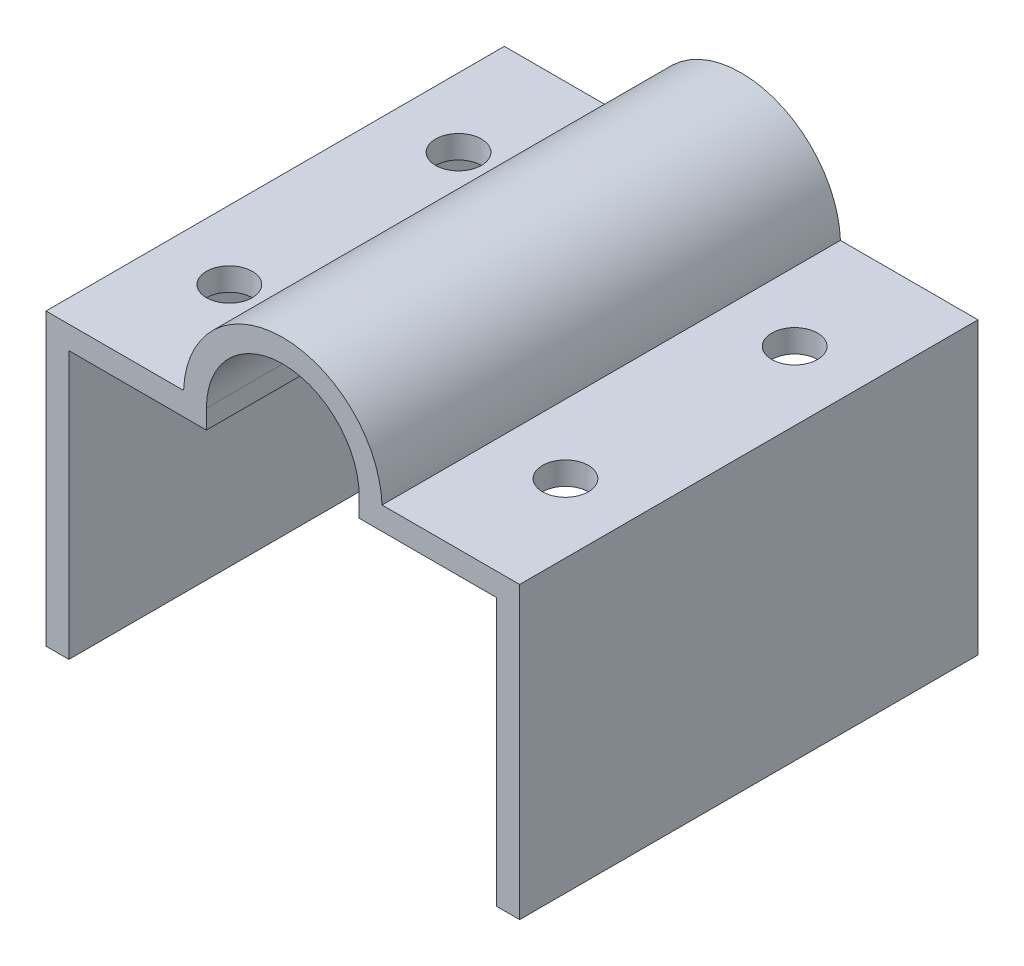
ISO-10303-21;
HEADER;
FILE_DESCRIPTION(('STEP AP214'),'2;1');
FILE_NAME('part.step','',(''),(''),'','','');
FILE_SCHEMA(('AUTOMOTIVE_DESIGN { 1 0 10303 214 1 1 1 1 }'));
ENDSEC;
DATA;
#1=APPLICATION_CONTEXT('core data for automotive mechanical design processes');
#2=APPLICATION_PROTOCOL_DEFINITION('international standard','automotive_design',2000,#1);
#3=PRODUCT_CONTEXT('',#1,'mechanical');
#4=PRODUCT('Part','Part','',(#3));
#5=PRODUCT_RELATED_PRODUCT_CATEGORY('part','',(#4));
#6=PRODUCT_DEFINITION_FORMATION('','',#4);
#7=PRODUCT_DEFINITION_CONTEXT('part definition',#1,'design');
#8=PRODUCT_DEFINITION('design','',#6,#7);
#9=PRODUCT_DEFINITION_SHAPE('','',#8);
#10=(LENGTH_UNIT() NAMED_UNIT(*) SI_UNIT(.MILLI.,.METRE.));
#11=(NAMED_UNIT(*) PLANE_ANGLE_UNIT() SI_UNIT($,.RADIAN.));
#12=(NAMED_UNIT(*) SI_UNIT($,.STERADIAN.) SOLID_ANGLE_UNIT());
#13=UNCERTAINTY_MEASURE_WITH_UNIT(LENGTH_MEASURE(1.E-05),#10,'distance_accuracy_value','');
#14=(GEOMETRIC_REPRESENTATION_CONTEXT(3) GLOBAL_UNCERTAINTY_ASSIGNED_CONTEXT((#13)) GLOBAL_UNIT_ASSIGNED_CONTEXT((#10,
#11,#12)) REPRESENTATION_CONTEXT('',''));
#15=CARTESIAN_POINT('',(0.,0.,0.));
#16=DIRECTION('',(0.,0.,1.));
#17=DIRECTION('',(1.,0.,0.));
#18=AXIS2_PLACEMENT_3D('',#15,#16,#17);
#19=CARTESIAN_POINT('',(-12.9903810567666,38.,30.));
#20=DIRECTION('',(0.,-1.,0.));
#21=DIRECTION('',(1.,0.,0.));
#22=AXIS2_PLACEMENT_3D('',#19,#20,#21);
#23=PLANE('',#22);
#24=CARTESIAN_POINT('',(-22.0000000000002,38.,15.));
#25=DIRECTION('',(0.,1.,0.));
#26=DIRECTION('',(0.,0.,1.));
#27=AXIS2_PLACEMENT_3D('',#24,#25,#26);
#28=CIRCLE('',#27,3.);
#29=CARTESIAN_POINT('',(-22.0000000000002,38.,18.));
#30=VERTEX_POINT('',#29);
#31=EDGE_CURVE('E456',#30,#30,#28,.T.);
#32=ORIENTED_EDGE('',*,*,#31,.F.);
#33=EDGE_LOOP('',(#32));
#34=FACE_BOUND('',#33,.T.);
#35=DIRECTION('',(-1.,0.,0.));
#36=VECTOR('',#35,1.);
#37=CARTESIAN_POINT('',(-12.9903810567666,38.,-30.));
#38=LINE('',#37,#36);
#39=CARTESIAN_POINT('',(-12.9903810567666,38.,-30.));
#40=VERTEX_POINT('',#39);
#41=CARTESIAN_POINT('',(-31.,38.,-30.));
#42=VERTEX_POINT('',#41);
#43=EDGE_CURVE('E99',#40,#42,#38,.T.);
#44=ORIENTED_EDGE('',*,*,#43,.T.);
#45=DIRECTION('',(0.,0.,-1.));
#46=VECTOR('',#45,1.);
#47=CARTESIAN_POINT('',(-31.,38.,30.));
#48=LINE('',#47,#46);
#49=CARTESIAN_POINT('',(-31.,38.,30.));
#50=VERTEX_POINT('',#49);
#51=EDGE_CURVE('E160',#50,#42,#48,.T.);
#52=ORIENTED_EDGE('',*,*,#51,.F.);
#53=DIRECTION('',(-1.,0.,0.));
#54=VECTOR('',#53,1.);
#55=CARTESIAN_POINT('',(-12.9903810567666,38.,30.));
#56=LINE('',#55,#54);
#57=CARTESIAN_POINT('',(-12.9903810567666,38.,30.));
#58=VERTEX_POINT('',#57);
#59=EDGE_CURVE('E148',#58,#50,#56,.T.);
#60=ORIENTED_EDGE('',*,*,#59,.F.);
#61=DIRECTION('',(0.,0.,-1.));
#62=VECTOR('',#61,1.);
#63=CARTESIAN_POINT('',(-12.9903810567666,38.,30.));
#64=LINE('',#63,#62);
#65=EDGE_CURVE('E155',#58,#40,#64,.T.);
#66=ORIENTED_EDGE('',*,*,#65,.T.);
#67=EDGE_LOOP('',(#44,#52,#60,#66));
#68=FACE_BOUND('',#67,.T.);
#69=CARTESIAN_POINT('',(-22.0000000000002,38.,-15.));
#70=DIRECTION('',(0.,1.,0.));
#71=DIRECTION('',(0.,0.,1.));
#72=AXIS2_PLACEMENT_3D('',#69,#70,#71);
#73=CIRCLE('',#72,3.);
#74=CARTESIAN_POINT('',(-22.0000000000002,38.,-12.));
#75=VERTEX_POINT('',#74);
#76=EDGE_CURVE('E458',#75,#75,#73,.T.);
#77=ORIENTED_EDGE('',*,*,#76,.F.);
#78=EDGE_LOOP('',(#77));
#79=FACE_BOUND('',#78,.T.);
#80=ADVANCED_FACE('F35',(#34,#68,#79),#23,.F.);
#81=CARTESIAN_POINT('',(31.,38.,30.));
#82=DIRECTION('',(0.,-1.,0.));
#83=DIRECTION('',(1.,0.,0.));
#84=AXIS2_PLACEMENT_3D('',#81,#82,#83);
#85=PLANE('',#84);
#86=CARTESIAN_POINT('',(21.9999999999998,38.,-15.));
#87=DIRECTION('',(0.,1.,0.));
#88=DIRECTION('',(0.,0.,1.));
#89=AXIS2_PLACEMENT_3D('',#86,#87,#88);
#90=CIRCLE('',#89,3.);
#91=CARTESIAN_POINT('',(21.9999999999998,38.,-12.));
#92=VERTEX_POINT('',#91);
#93=EDGE_CURVE('E466',#92,#92,#90,.T.);
#94=ORIENTED_EDGE('',*,*,#93,.F.);
#95=EDGE_LOOP('',(#94));
#96=FACE_BOUND('',#95,.T.);
#97=DIRECTION('',(-1.,0.,0.));
#98=VECTOR('',#97,1.);
#99=CARTESIAN_POINT('',(31.,38.,-30.));
#100=LINE('',#99,#98);
#101=CARTESIAN_POINT('',(31.,38.,-30.));
#102=VERTEX_POINT('',#101);
#103=CARTESIAN_POINT('',(12.9903810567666,38.,-30.));
#104=VERTEX_POINT('',#103);
#105=EDGE_CURVE('E190',#102,#104,#100,.T.);
#106=ORIENTED_EDGE('',*,*,#105,.T.);
#107=DIRECTION('',(0.,0.,-1.));
#108=VECTOR('',#107,1.);
#109=CARTESIAN_POINT('',(12.9903810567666,38.,30.));
#110=LINE('',#109,#108);
#111=CARTESIAN_POINT('',(12.9903810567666,38.,30.));
#112=VERTEX_POINT('',#111);
#113=EDGE_CURVE('E159',#112,#104,#110,.T.);
#114=ORIENTED_EDGE('',*,*,#113,.F.);
#115=DIRECTION('',(-1.,0.,0.));
#116=VECTOR('',#115,1.);
#117=CARTESIAN_POINT('',(31.,38.,30.));
#118=LINE('',#117,#116);
#119=CARTESIAN_POINT('',(31.,38.,30.));
#120=VERTEX_POINT('',#119);
#121=EDGE_CURVE('E150',#120,#112,#118,.T.);
#122=ORIENTED_EDGE('',*,*,#121,.F.);
#123=DIRECTION('',(0.,0.,-1.));
#124=VECTOR('',#123,1.);
#125=CARTESIAN_POINT('',(31.,38.,30.));
#126=LINE('',#125,#124);
#127=EDGE_CURVE('E199',#120,#102,#126,.T.);
#128=ORIENTED_EDGE('',*,*,#127,.T.);
#129=EDGE_LOOP('',(#106,#114,#122,#128));
#130=FACE_BOUND('',#129,.T.);
#131=CARTESIAN_POINT('',(21.9999999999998,38.,15.));
#132=DIRECTION('',(0.,1.,0.));
#133=DIRECTION('',(0.,0.,1.));
#134=AXIS2_PLACEMENT_3D('',#131,#132,#133);
#135=CIRCLE('',#134,3.);
#136=CARTESIAN_POINT('',(21.9999999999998,38.,18.));
#137=VERTEX_POINT('',#136);
#138=EDGE_CURVE('E472',#137,#137,#135,.T.);
#139=ORIENTED_EDGE('',*,*,#138,.F.);
#140=EDGE_LOOP('',(#139));
#141=FACE_BOUND('',#140,.T.);
#142=ADVANCED_FACE('F268',(#96,#130,#141),#85,.F.);
#143=CARTESIAN_POINT('',(-28.,0.,30.));
#144=DIRECTION('',(0.,1.,0.));
#145=DIRECTION('',(0.,0.,1.));
#146=AXIS2_PLACEMENT_3D('',#143,#144,#145);
#147=PLANE('',#146);
#148=DIRECTION('',(1.,0.,0.));
#149=VECTOR('',#148,1.);
#150=CARTESIAN_POINT('',(-28.,0.,-30.));
#151=LINE('',#150,#149);
#152=CARTESIAN_POINT('',(-31.,0.,-30.));
#153=VERTEX_POINT('',#152);
#154=CARTESIAN_POINT('',(-28.,0.,-30.));
#155=VERTEX_POINT('',#154);
#156=EDGE_CURVE('E168',#153,#155,#151,.T.);
#157=ORIENTED_EDGE('',*,*,#156,.T.);
#158=DIRECTION('',(0.,0.,-1.));
#159=VECTOR('',#158,1.);
#160=CARTESIAN_POINT('',(-28.,0.,30.));
#161=LINE('',#160,#159);
#162=CARTESIAN_POINT('',(-28.,0.,30.));
#163=VERTEX_POINT('',#162);
#164=EDGE_CURVE('E11',#163,#155,#161,.T.);
#165=ORIENTED_EDGE('',*,*,#164,.F.);
#166=DIRECTION('',(1.,0.,0.));
#167=VECTOR('',#166,1.);
#168=CARTESIAN_POINT('',(-28.,0.,30.));
#169=LINE('',#168,#167);
#170=CARTESIAN_POINT('',(-31.,0.,30.));
#171=VERTEX_POINT('',#170);
#172=EDGE_CURVE('E195',#171,#163,#169,.T.);
#173=ORIENTED_EDGE('',*,*,#172,.F.);
#174=DIRECTION('',(0.,0.,-1.));
#175=VECTOR('',#174,1.);
#176=CARTESIAN_POINT('',(-31.,0.,30.));
#177=LINE('',#176,#175);
#178=EDGE_CURVE('E164',#171,#153,#177,.T.);
#179=ORIENTED_EDGE('',*,*,#178,.T.);
#180=EDGE_LOOP('',(#157,#165,#173,#179));
#181=FACE_BOUND('',#180,.T.);
#182=ADVANCED_FACE('F37',(#181),#147,.F.);
#183=CARTESIAN_POINT('',(-28.,0.,30.));
#184=DIRECTION('',(-1.,0.,0.));
#185=DIRECTION('',(0.,-1.,0.));
#186=AXIS2_PLACEMENT_3D('',#183,#184,#185);
#187=PLANE('',#186);
#188=DIRECTION('',(0.,1.,0.));
#189=VECTOR('',#188,1.);
#190=CARTESIAN_POINT('',(-28.,0.,-30.));
#191=LINE('',#190,#189);
#192=CARTESIAN_POINT('',(-28.,35.,-30.));
#193=VERTEX_POINT('',#192);
#194=EDGE_CURVE('E171',#155,#193,#191,.T.);
#195=ORIENTED_EDGE('',*,*,#194,.T.);
#196=DIRECTION('',(0.,0.,-1.));
#197=VECTOR('',#196,1.);
#198=CARTESIAN_POINT('',(-28.,35.,30.));
#199=LINE('',#198,#197);
#200=CARTESIAN_POINT('',(-28.,35.,30.));
#201=VERTEX_POINT('',#200);
#202=EDGE_CURVE('E44',#201,#193,#199,.T.);
#203=ORIENTED_EDGE('',*,*,#202,.F.);
#204=DIRECTION('',(0.,1.,0.));
#205=VECTOR('',#204,1.);
#206=CARTESIAN_POINT('',(-28.,0.,30.));
#207=LINE('',#206,#205);
#208=EDGE_CURVE('E113',#163,#201,#207,.T.);
#209=ORIENTED_EDGE('',*,*,#208,.F.);
#210=ORIENTED_EDGE('',*,*,#164,.T.);
#211=EDGE_LOOP('',(#195,#203,#209,#210));
#212=FACE_BOUND('',#211,.T.);
#213=ADVANCED_FACE('F316',(#212),#187,.F.);
#214=CARTESIAN_POINT('',(-28.,35.,30.));
#215=DIRECTION('',(0.,1.,0.));
#216=DIRECTION('',(-1.,0.,0.));
#217=AXIS2_PLACEMENT_3D('',#214,#215,#216);
#218=PLANE('',#217);
#219=CARTESIAN_POINT('',(-22.0000000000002,35.,15.));
#220=DIRECTION('',(0.,1.,0.));
#221=DIRECTION('',(-1.,0.,0.));
#222=AXIS2_PLACEMENT_3D('',#219,#220,#221);
#223=CIRCLE('',#222,3.);
#224=CARTESIAN_POINT('',(-25.0000000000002,35.,15.));
#225=VERTEX_POINT('',#224);
#226=EDGE_CURVE('E454',#225,#225,#223,.T.);
#227=ORIENTED_EDGE('',*,*,#226,.T.);
#228=EDGE_LOOP('',(#227));
#229=FACE_BOUND('',#228,.T.);
#230=CARTESIAN_POINT('',(-22.0000000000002,35.,-15.));
#231=DIRECTION('',(0.,1.,0.));
#232=DIRECTION('',(-1.,0.,0.));
#233=AXIS2_PLACEMENT_3D('',#230,#231,#232);
#234=CIRCLE('',#233,3.);
#235=CARTESIAN_POINT('',(-25.0000000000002,35.,-15.));
#236=VERTEX_POINT('',#235);
#237=EDGE_CURVE('E463',#236,#236,#234,.T.);
#238=ORIENTED_EDGE('',*,*,#237,.T.);
#239=EDGE_LOOP('',(#238));
#240=FACE_BOUND('',#239,.T.);
#241=DIRECTION('',(1.,0.,0.));
#242=VECTOR('',#241,1.);
#243=CARTESIAN_POINT('',(-28.,35.,-30.));
#244=LINE('',#243,#242);
#245=CARTESIAN_POINT('',(-10.,35.,-30.));
#246=VERTEX_POINT('',#245);
#247=EDGE_CURVE('E174',#193,#246,#244,.T.);
#248=ORIENTED_EDGE('',*,*,#247,.T.);
#249=DIRECTION('',(0.,0.,-1.));
#250=VECTOR('',#249,1.);
#251=CARTESIAN_POINT('',(-10.,35.,30.));
#252=LINE('',#251,#250);
#253=CARTESIAN_POINT('',(-10.,35.,30.));
#254=VERTEX_POINT('',#253);
#255=EDGE_CURVE('E220',#254,#246,#252,.T.);
#256=ORIENTED_EDGE('',*,*,#255,.F.);
#257=DIRECTION('',(1.,0.,0.));
#258=VECTOR('',#257,1.);
#259=CARTESIAN_POINT('',(-28.,35.,30.));
#260=LINE('',#259,#258);
#261=EDGE_CURVE('E228',#201,#254,#260,.T.);
#262=ORIENTED_EDGE('',*,*,#261,.F.);
#263=ORIENTED_EDGE('',*,*,#202,.T.);
#264=EDGE_LOOP('',(#248,#256,#262,#263));
#265=FACE_BOUND('',#264,.T.);
#266=ADVANCED_FACE('F226',(#229,#240,#265),#218,.F.);
#267=CARTESIAN_POINT('',(-10.,35.,30.));
#268=DIRECTION('',(-1.,0.,0.));
#269=DIRECTION('',(0.,-1.,0.));
#270=AXIS2_PLACEMENT_3D('',#267,#268,#269);
#271=PLANE('',#270);
#272=DIRECTION('',(0.,1.,0.));
#273=VECTOR('',#272,1.);
#274=CARTESIAN_POINT('',(-10.,35.,-30.));
#275=LINE('',#274,#273);
#276=CARTESIAN_POINT('',(-10.,37.5,-30.));
#277=VERTEX_POINT('',#276);
#278=EDGE_CURVE('E176',#246,#277,#275,.T.);
#279=ORIENTED_EDGE('',*,*,#278,.T.);
#280=DIRECTION('',(0.,0.,-1.));
#281=VECTOR('',#280,1.);
#282=CARTESIAN_POINT('',(-10.,37.5,30.));
#283=LINE('',#282,#281);
#284=CARTESIAN_POINT('',(-10.,37.5,30.));
#285=VERTEX_POINT('',#284);
#286=EDGE_CURVE('E217',#285,#277,#283,.T.);
#287=ORIENTED_EDGE('',*,*,#286,.F.);
#288=DIRECTION('',(0.,1.,0.));
#289=VECTOR('',#288,1.);
#290=CARTESIAN_POINT('',(-10.,35.,30.));
#291=LINE('',#290,#289);
#292=EDGE_CURVE('E246',#254,#285,#291,.T.);
#293=ORIENTED_EDGE('',*,*,#292,.F.);
#294=ORIENTED_EDGE('',*,*,#255,.T.);
#295=EDGE_LOOP('',(#279,#287,#293,#294));
#296=FACE_BOUND('',#295,.T.);
#297=ADVANCED_FACE('F237',(#296),#271,.F.);
#298=CARTESIAN_POINT('',(0.,37.5,30.));
#299=DIRECTION('',(0.,0.,-1.));
#300=DIRECTION('',(-1.,0.,0.));
#301=AXIS2_PLACEMENT_3D('',#298,#299,#300);
#302=CYLINDRICAL_SURFACE('',#301,10.);
#303=CARTESIAN_POINT('',(0.,37.5,-30.));
#304=DIRECTION('',(0.,0.,-1.));
#305=DIRECTION('',(1.,0.,0.));
#306=AXIS2_PLACEMENT_3D('',#303,#304,#305);
#307=CIRCLE('',#306,10.);
#308=CARTESIAN_POINT('',(10.,37.5,-30.));
#309=VERTEX_POINT('',#308);
#310=EDGE_CURVE('E178',#277,#309,#307,.T.);
#311=ORIENTED_EDGE('',*,*,#310,.T.);
#312=DIRECTION('',(0.,0.,-1.));
#313=VECTOR('',#312,1.);
#314=CARTESIAN_POINT('',(10.,37.5,30.));
#315=LINE('',#314,#313);
#316=CARTESIAN_POINT('',(10.,37.5,30.));
#317=VERTEX_POINT('',#316);
#318=EDGE_CURVE('E214',#317,#309,#315,.T.);
#319=ORIENTED_EDGE('',*,*,#318,.F.);
#320=CARTESIAN_POINT('',(0.,37.5,30.));
#321=DIRECTION('',(0.,0.,-1.));
#322=DIRECTION('',(1.,0.,0.));
#323=AXIS2_PLACEMENT_3D('',#320,#321,#322);
#324=CIRCLE('',#323,10.);
#325=EDGE_CURVE('E243',#285,#317,#324,.T.);
#326=ORIENTED_EDGE('',*,*,#325,.F.);
#327=ORIENTED_EDGE('',*,*,#286,.T.);
#328=EDGE_LOOP('',(#311,#319,#326,#327));
#329=FACE_BOUND('',#328,.T.);
#330=ADVANCED_FACE('F241',(#329),#302,.F.);
#331=CARTESIAN_POINT('',(10.,35.,30.));
#332=DIRECTION('',(1.,0.,0.));
#333=DIRECTION('',(0.,0.,-1.));
#334=AXIS2_PLACEMENT_3D('',#331,#332,#333);
#335=PLANE('',#334);
#336=DIRECTION('',(0.,-1.,0.));
#337=VECTOR('',#336,1.);
#338=CARTESIAN_POINT('',(10.,35.,-30.));
#339=LINE('',#338,#337);
#340=CARTESIAN_POINT('',(10.,35.,-30.));
#341=VERTEX_POINT('',#340);
#342=EDGE_CURVE('E180',#309,#341,#339,.T.);
#343=ORIENTED_EDGE('',*,*,#342,.T.);
#344=DIRECTION('',(0.,0.,-1.));
#345=VECTOR('',#344,1.);
#346=CARTESIAN_POINT('',(10.,35.,30.));
#347=LINE('',#346,#345);
#348=CARTESIAN_POINT('',(10.,35.,30.));
#349=VERTEX_POINT('',#348);
#350=EDGE_CURVE('E211',#349,#341,#347,.T.);
#351=ORIENTED_EDGE('',*,*,#350,.F.);
#352=DIRECTION('',(0.,-1.,0.));
#353=VECTOR('',#352,1.);
#354=CARTESIAN_POINT('',(10.,35.,30.));
#355=LINE('',#354,#353);
#356=EDGE_CURVE('E245',#317,#349,#355,.T.);
#357=ORIENTED_EDGE('',*,*,#356,.F.);
#358=ORIENTED_EDGE('',*,*,#318,.T.);
#359=EDGE_LOOP('',(#343,#351,#357,#358));
#360=FACE_BOUND('',#359,.T.);
#361=ADVANCED_FACE('F306',(#360),#335,.F.);
#362=CARTESIAN_POINT('',(10.,35.,30.));
#363=DIRECTION('',(0.,1.,0.));
#364=DIRECTION('',(-1.,0.,0.));
#365=AXIS2_PLACEMENT_3D('',#362,#363,#364);
#366=PLANE('',#365);
#367=CARTESIAN_POINT('',(21.9999999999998,35.,-15.));
#368=DIRECTION('',(0.,1.,0.));
#369=DIRECTION('',(-1.,0.,0.));
#370=AXIS2_PLACEMENT_3D('',#367,#368,#369);
#371=CIRCLE('',#370,3.);
#372=CARTESIAN_POINT('',(18.9999999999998,35.,-15.));
#373=VERTEX_POINT('',#372);
#374=EDGE_CURVE('E469',#373,#373,#371,.T.);
#375=ORIENTED_EDGE('',*,*,#374,.T.);
#376=EDGE_LOOP('',(#375));
#377=FACE_BOUND('',#376,.T.);
#378=CARTESIAN_POINT('',(21.9999999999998,35.,15.));
#379=DIRECTION('',(0.,1.,0.));
#380=DIRECTION('',(-1.,0.,0.));
#381=AXIS2_PLACEMENT_3D('',#378,#379,#380);
#382=CIRCLE('',#381,3.);
#383=CARTESIAN_POINT('',(18.9999999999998,35.,15.));
#384=VERTEX_POINT('',#383);
#385=EDGE_CURVE('E172',#384,#384,#382,.T.);
#386=ORIENTED_EDGE('',*,*,#385,.T.);
#387=EDGE_LOOP('',(#386));
#388=FACE_BOUND('',#387,.T.);
#389=DIRECTION('',(1.,0.,0.));
#390=VECTOR('',#389,1.);
#391=CARTESIAN_POINT('',(10.,35.,-30.));
#392=LINE('',#391,#390);
#393=CARTESIAN_POINT('',(28.,35.,-30.));
#394=VERTEX_POINT('',#393);
#395=EDGE_CURVE('E182',#341,#394,#392,.T.);
#396=ORIENTED_EDGE('',*,*,#395,.T.);
#397=DIRECTION('',(0.,0.,-1.));
#398=VECTOR('',#397,1.);
#399=CARTESIAN_POINT('',(28.,35.,30.));
#400=LINE('',#399,#398);
#401=CARTESIAN_POINT('',(28.,35.,30.));
#402=VERTEX_POINT('',#401);
#403=EDGE_CURVE('E208',#402,#394,#400,.T.);
#404=ORIENTED_EDGE('',*,*,#403,.F.);
#405=DIRECTION('',(1.,0.,0.));
#406=VECTOR('',#405,1.);
#407=CARTESIAN_POINT('',(10.,35.,30.));
#408=LINE('',#407,#406);
#409=EDGE_CURVE('E248',#349,#402,#408,.T.);
#410=ORIENTED_EDGE('',*,*,#409,.F.);
#411=ORIENTED_EDGE('',*,*,#350,.T.);
#412=EDGE_LOOP('',(#396,#404,#410,#411));
#413=FACE_BOUND('',#412,.T.);
#414=ADVANCED_FACE('F302',(#377,#388,#413),#366,.F.);
#415=CARTESIAN_POINT('',(28.,35.,30.));
#416=DIRECTION('',(1.,0.,0.));
#417=DIRECTION('',(0.,0.,-1.));
#418=AXIS2_PLACEMENT_3D('',#415,#416,#417);
#419=PLANE('',#418);
#420=DIRECTION('',(0.,-1.,0.));
#421=VECTOR('',#420,1.);
#422=CARTESIAN_POINT('',(28.,35.,-30.));
#423=LINE('',#422,#421);
#424=CARTESIAN_POINT('',(28.,0.,-30.));
#425=VERTEX_POINT('',#424);
#426=EDGE_CURVE('E184',#394,#425,#423,.T.);
#427=ORIENTED_EDGE('',*,*,#426,.T.);
#428=DIRECTION('',(0.,0.,-1.));
#429=VECTOR('',#428,1.);
#430=CARTESIAN_POINT('',(28.,0.,30.));
#431=LINE('',#430,#429);
#432=CARTESIAN_POINT('',(28.,0.,30.));
#433=VERTEX_POINT('',#432);
#434=EDGE_CURVE('E205',#433,#425,#431,.T.);
#435=ORIENTED_EDGE('',*,*,#434,.F.);
#436=DIRECTION('',(0.,-1.,0.));
#437=VECTOR('',#436,1.);
#438=CARTESIAN_POINT('',(28.,35.,30.));
#439=LINE('',#438,#437);
#440=EDGE_CURVE('E254',#402,#433,#439,.T.);
#441=ORIENTED_EDGE('',*,*,#440,.F.);
#442=ORIENTED_EDGE('',*,*,#403,.T.);
#443=EDGE_LOOP('',(#427,#435,#441,#442));
#444=FACE_BOUND('',#443,.T.);
#445=ADVANCED_FACE('F298',(#444),#419,.F.);
#446=CARTESIAN_POINT('',(28.,0.,30.));
#447=DIRECTION('',(0.,1.,0.));
#448=DIRECTION('',(0.,0.,1.));
#449=AXIS2_PLACEMENT_3D('',#446,#447,#448);
#450=PLANE('',#449);
#451=DIRECTION('',(1.,0.,0.));
#452=VECTOR('',#451,1.);
#453=CARTESIAN_POINT('',(28.,0.,-30.));
#454=LINE('',#453,#452);
#455=CARTESIAN_POINT('',(31.,0.,-30.));
#456=VERTEX_POINT('',#455);
#457=EDGE_CURVE('E186',#425,#456,#454,.T.);
#458=ORIENTED_EDGE('',*,*,#457,.T.);
#459=DIRECTION('',(0.,0.,-1.));
#460=VECTOR('',#459,1.);
#461=CARTESIAN_POINT('',(31.,0.,30.));
#462=LINE('',#461,#460);
#463=CARTESIAN_POINT('',(31.,0.,30.));
#464=VERTEX_POINT('',#463);
#465=EDGE_CURVE('E202',#464,#456,#462,.T.);
#466=ORIENTED_EDGE('',*,*,#465,.F.);
#467=DIRECTION('',(1.,0.,0.));
#468=VECTOR('',#467,1.);
#469=CARTESIAN_POINT('',(28.,0.,30.));
#470=LINE('',#469,#468);
#471=EDGE_CURVE('E256',#433,#464,#470,.T.);
#472=ORIENTED_EDGE('',*,*,#471,.F.);
#473=ORIENTED_EDGE('',*,*,#434,.T.);
#474=EDGE_LOOP('',(#458,#466,#472,#473));
#475=FACE_BOUND('',#474,.T.);
#476=ADVANCED_FACE('F295',(#475),#450,.F.);
#477=CARTESIAN_POINT('',(31.,0.,30.));
#478=DIRECTION('',(-1.,0.,0.));
#479=DIRECTION('',(0.,0.,1.));
#480=AXIS2_PLACEMENT_3D('',#477,#478,#479);
#481=PLANE('',#480);
#482=DIRECTION('',(0.,1.,0.));
#483=VECTOR('',#482,1.);
#484=CARTESIAN_POINT('',(31.,0.,-30.));
#485=LINE('',#484,#483);
#486=EDGE_CURVE('E188',#456,#102,#485,.T.);
#487=ORIENTED_EDGE('',*,*,#486,.T.);
#488=ORIENTED_EDGE('',*,*,#127,.F.);
#489=DIRECTION('',(0.,1.,0.));
#490=VECTOR('',#489,1.);
#491=CARTESIAN_POINT('',(31.,0.,30.));
#492=LINE('',#491,#490);
#493=EDGE_CURVE('E258',#464,#120,#492,.T.);
#494=ORIENTED_EDGE('',*,*,#493,.F.);
#495=ORIENTED_EDGE('',*,*,#465,.T.);
#496=EDGE_LOOP('',(#487,#488,#494,#495));
#497=FACE_BOUND('',#496,.T.);
#498=ADVANCED_FACE('F264',(#497),#481,.F.);
#499=CARTESIAN_POINT('',(0.,37.5,30.));
#500=DIRECTION('',(0.,0.,-1.));
#501=DIRECTION('',(-1.,0.,0.));
#502=AXIS2_PLACEMENT_3D('',#499,#500,#501);
#503=CYLINDRICAL_SURFACE('',#502,13.);
#504=CARTESIAN_POINT('',(0.,37.5,-30.));
#505=DIRECTION('',(0.,0.,1.));
#506=DIRECTION('',(1.,0.,0.));
#507=AXIS2_PLACEMENT_3D('',#504,#505,#506);
#508=CIRCLE('',#507,13.);
#509=EDGE_CURVE('E158',#104,#40,#508,.T.);
#510=ORIENTED_EDGE('',*,*,#509,.T.);
#511=ORIENTED_EDGE('',*,*,#65,.F.);
#512=CARTESIAN_POINT('',(0.,37.5,30.));
#513=DIRECTION('',(0.,0.,1.));
#514=DIRECTION('',(1.,0.,0.));
#515=AXIS2_PLACEMENT_3D('',#512,#513,#514);
#516=CIRCLE('',#515,13.);
#517=EDGE_CURVE('E144',#112,#58,#516,.T.);
#518=ORIENTED_EDGE('',*,*,#517,.F.);
#519=ORIENTED_EDGE('',*,*,#113,.T.);
#520=EDGE_LOOP('',(#510,#511,#518,#519));
#521=FACE_BOUND('',#520,.T.);
#522=ADVANCED_FACE('F156',(#521),#503,.T.);
#523=CARTESIAN_POINT('',(-31.,0.,30.));
#524=DIRECTION('',(1.,0.,0.));
#525=DIRECTION('',(0.,1.,0.));
#526=AXIS2_PLACEMENT_3D('',#523,#524,#525);
#527=PLANE('',#526);
#528=DIRECTION('',(0.,-1.,0.));
#529=VECTOR('',#528,1.);
#530=CARTESIAN_POINT('',(-31.,0.,-30.));
#531=LINE('',#530,#529);
#532=EDGE_CURVE('E105',#42,#153,#531,.T.);
#533=ORIENTED_EDGE('',*,*,#532,.T.);
#534=ORIENTED_EDGE('',*,*,#178,.F.);
#535=DIRECTION('',(0.,-1.,0.));
#536=VECTOR('',#535,1.);
#537=CARTESIAN_POINT('',(-31.,0.,30.));
#538=LINE('',#537,#536);
#539=EDGE_CURVE('E52',#50,#171,#538,.T.);
#540=ORIENTED_EDGE('',*,*,#539,.F.);
#541=ORIENTED_EDGE('',*,*,#51,.T.);
#542=EDGE_LOOP('',(#533,#534,#540,#541));
#543=FACE_BOUND('',#542,.T.);
#544=ADVANCED_FACE('F273',(#543),#527,.F.);
#545=CARTESIAN_POINT('',(0.,37.5,30.));
#546=DIRECTION('',(0.,0.,1.));
#547=DIRECTION('',(1.,0.,0.));
#548=AXIS2_PLACEMENT_3D('',#545,#546,#547);
#549=PLANE('',#548);
#550=ORIENTED_EDGE('',*,*,#172,.T.);
#551=ORIENTED_EDGE('',*,*,#208,.T.);
#552=ORIENTED_EDGE('',*,*,#261,.T.);
#553=ORIENTED_EDGE('',*,*,#292,.T.);
#554=ORIENTED_EDGE('',*,*,#325,.T.);
#555=ORIENTED_EDGE('',*,*,#356,.T.);
#556=ORIENTED_EDGE('',*,*,#409,.T.);
#557=ORIENTED_EDGE('',*,*,#440,.T.);
#558=ORIENTED_EDGE('',*,*,#471,.T.);
#559=ORIENTED_EDGE('',*,*,#493,.T.);
#560=ORIENTED_EDGE('',*,*,#121,.T.);
#561=ORIENTED_EDGE('',*,*,#517,.T.);
#562=ORIENTED_EDGE('',*,*,#59,.T.);
#563=ORIENTED_EDGE('',*,*,#539,.T.);
#564=EDGE_LOOP('',(#550,#551,#552,#553,#554,#555,#556,#557,#558,#559,#560,#561,#562,#563));
#565=FACE_BOUND('',#564,.T.);
#566=ADVANCED_FACE('F146',(#565),#549,.T.);
#567=CARTESIAN_POINT('',(0.,37.5,-30.));
#568=DIRECTION('',(0.,0.,1.));
#569=DIRECTION('',(1.,0.,0.));
#570=AXIS2_PLACEMENT_3D('',#567,#568,#569);
#571=PLANE('',#570);
#572=ORIENTED_EDGE('',*,*,#156,.F.);
#573=ORIENTED_EDGE('',*,*,#532,.F.);
#574=ORIENTED_EDGE('',*,*,#43,.F.);
#575=ORIENTED_EDGE('',*,*,#509,.F.);
#576=ORIENTED_EDGE('',*,*,#105,.F.);
#577=ORIENTED_EDGE('',*,*,#486,.F.);
#578=ORIENTED_EDGE('',*,*,#457,.F.);
#579=ORIENTED_EDGE('',*,*,#426,.F.);
#580=ORIENTED_EDGE('',*,*,#395,.F.);
#581=ORIENTED_EDGE('',*,*,#342,.F.);
#582=ORIENTED_EDGE('',*,*,#310,.F.);
#583=ORIENTED_EDGE('',*,*,#278,.F.);
#584=ORIENTED_EDGE('',*,*,#247,.F.);
#585=ORIENTED_EDGE('',*,*,#194,.F.);
#586=EDGE_LOOP('',(#572,#573,#574,#575,#576,#577,#578,#579,#580,#581,#582,#583,#584,#585));
#587=FACE_BOUND('',#586,.T.);
#588=ADVANCED_FACE('F232',(#587),#571,.F.);
#589=CARTESIAN_POINT('',(21.9999999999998,38.,15.));
#590=DIRECTION('',(0.,1.,0.));
#591=DIRECTION('',(0.,0.,1.));
#592=AXIS2_PLACEMENT_3D('',#589,#590,#591);
#593=CYLINDRICAL_SURFACE('',#592,3.);
#594=ORIENTED_EDGE('',*,*,#385,.F.);
#595=EDGE_LOOP('',(#594));
#596=FACE_BOUND('',#595,.T.);
#597=ORIENTED_EDGE('',*,*,#138,.T.);
#598=EDGE_LOOP('',(#597));
#599=FACE_BOUND('',#598,.T.);
#600=ADVANCED_FACE('F353',(#596,#599),#593,.F.);
#601=CARTESIAN_POINT('',(21.9999999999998,38.,-15.));
#602=DIRECTION('',(0.,1.,0.));
#603=DIRECTION('',(0.,0.,1.));
#604=AXIS2_PLACEMENT_3D('',#601,#602,#603);
#605=CYLINDRICAL_SURFACE('',#604,3.);
#606=ORIENTED_EDGE('',*,*,#374,.F.);
#607=EDGE_LOOP('',(#606));
#608=FACE_BOUND('',#607,.T.);
#609=ORIENTED_EDGE('',*,*,#93,.T.);
#610=EDGE_LOOP('',(#609));
#611=FACE_BOUND('',#610,.T.);
#612=ADVANCED_FACE('F358',(#608,#611),#605,.F.);
#613=CARTESIAN_POINT('',(-22.0000000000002,38.,-15.));
#614=DIRECTION('',(0.,1.,0.));
#615=DIRECTION('',(0.,0.,1.));
#616=AXIS2_PLACEMENT_3D('',#613,#614,#615);
#617=CYLINDRICAL_SURFACE('',#616,3.);
#618=ORIENTED_EDGE('',*,*,#237,.F.);
#619=EDGE_LOOP('',(#618));
#620=FACE_BOUND('',#619,.T.);
#621=ORIENTED_EDGE('',*,*,#76,.T.);
#622=EDGE_LOOP('',(#621));
#623=FACE_BOUND('',#622,.T.);
#624=ADVANCED_FACE('F369',(#620,#623),#617,.F.);
#625=CARTESIAN_POINT('',(-22.0000000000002,38.,15.));
#626=DIRECTION('',(0.,1.,0.));
#627=DIRECTION('',(0.,0.,1.));
#628=AXIS2_PLACEMENT_3D('',#625,#626,#627);
#629=CYLINDRICAL_SURFACE('',#628,3.);
#630=ORIENTED_EDGE('',*,*,#226,.F.);
#631=EDGE_LOOP('',(#630));
#632=FACE_BOUND('',#631,.T.);
#633=ORIENTED_EDGE('',*,*,#31,.T.);
#634=EDGE_LOOP('',(#633));
#635=FACE_BOUND('',#634,.T.);
#636=ADVANCED_FACE('F379',(#632,#635),#629,.F.);
#637=CLOSED_SHELL('',(#80,#142,#182,#213,#266,#297,#330,#361,#414,#445,#476,#498,#522,#544,#566,
#588,#600,#612,#624,#636));
#638=MANIFOLD_SOLID_BREP('B2',#637);
#639=ADVANCED_BREP_SHAPE_REPRESENTATION('',(#18,#638),#14);
#640=SHAPE_DEFINITION_REPRESENTATION(#9,#639);
ENDSEC;
END-ISO-10303-21;
